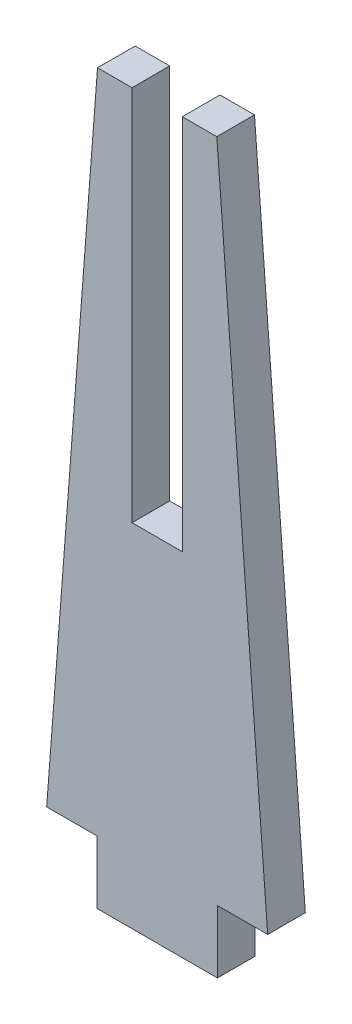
from build123d import *

# Parameters (mm, degrees)
SKETCH1_W           = 9.6
SKETCH1_H           = 5
BOSS_EXTRUDE1_DEPTH = 3


with BuildPart() as part:
    # Sketch1 → Boss-Extrude1 (new body)
    with BuildSketch(Plane.XY):
        Polygon((2, 25.5), (2, 55.5), (4.75, 55.5), (8.8, 2.5), (4.8, 2.5), (-4.8, 2.5), (-8.8, 2.5), (-4.75, 55.5), (-2, 55.5), (-2, 25.5), align=None)
        Rectangle(SKETCH1_W, SKETCH1_H)
    extrude(amount=BOSS_EXTRUDE1_DEPTH)


solid = part.part
